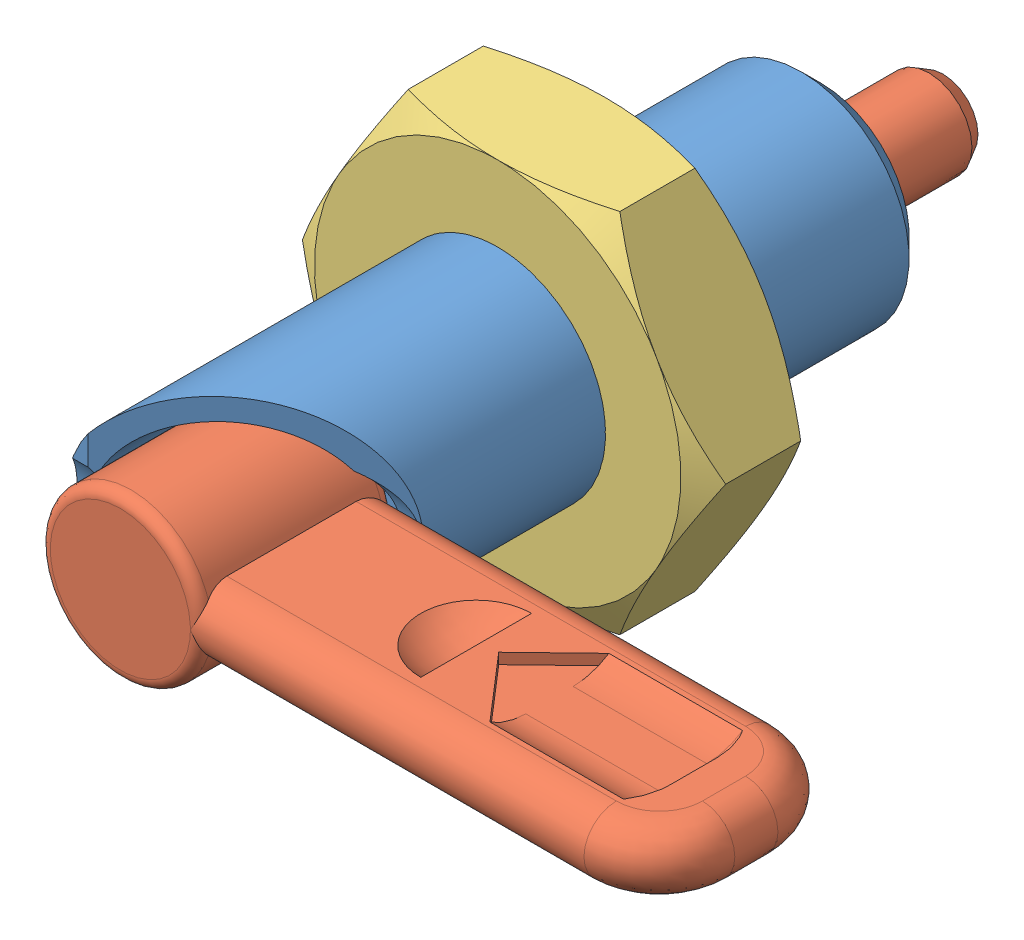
SolidWorks assembly GDX10LW-4N-SUS.sldasm, configuration Default (file format 15000). Lengths in mm.
Overall size (36.62 23.23 38.5).
3 component instances, 3 part files, 0 mates.
Components (placement in the parent):
- GDX10LW-4N-SUS_01-1: GDX10LW-4N-SUS_01.SLDPRT [ﾃﾞﾌｫﾙﾄ] x (1 0 0) z (0 -1 0) size (10.01 31.09 10.01)
- GDX10LW-4N-SUS_02-1: GDX10LW-4N-SUS_02.SLDPRT [ﾃﾞﾌｫﾙﾄ] x (1 0 0) z (0 -1 0) size (28.75 38.5 7.5)
- GDX10LW-4N-SUS_03-1: GDX10LW-4N-SUS_03.SLDPRT [ﾃﾞﾌｫﾙﾄ] at (0 0 10) x (0 0 1) z (0 1 0) size (5.01 23.23 23.23)
